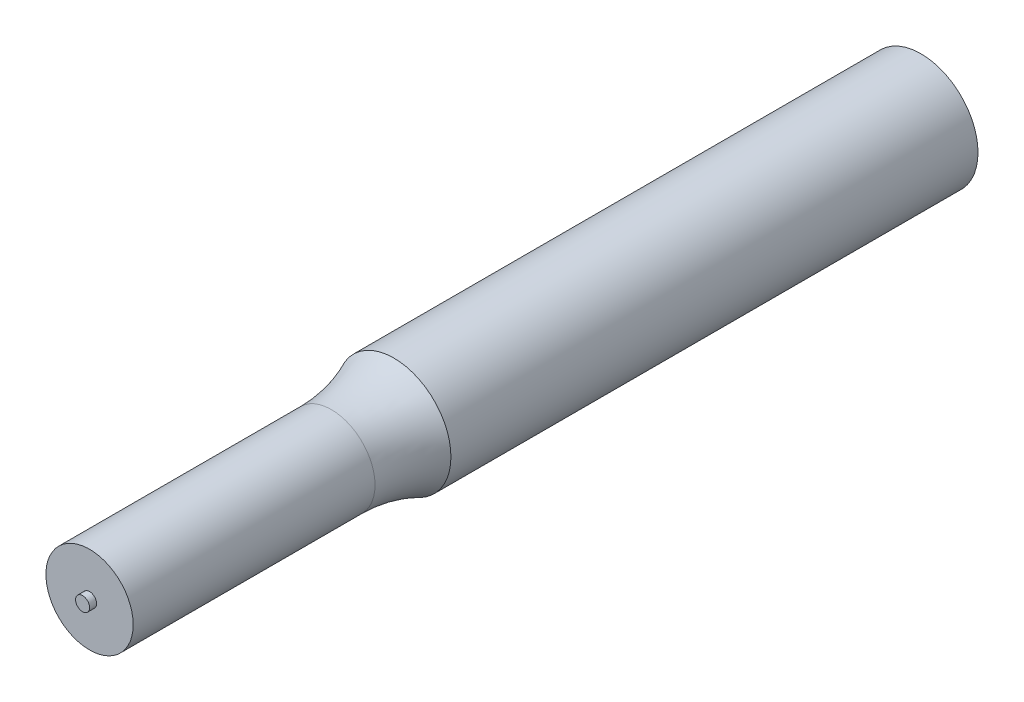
ISO-10303-21;
HEADER;
FILE_DESCRIPTION(('STEP AP214'),'2;1');
FILE_NAME('part.step','',(''),(''),'','','');
FILE_SCHEMA(('AUTOMOTIVE_DESIGN { 1 0 10303 214 1 1 1 1 }'));
ENDSEC;
DATA;
#1=APPLICATION_CONTEXT('core data for automotive mechanical design processes');
#2=APPLICATION_PROTOCOL_DEFINITION('international standard','automotive_design',2000,#1);
#3=PRODUCT_CONTEXT('',#1,'mechanical');
#4=PRODUCT('Part','Part','',(#3));
#5=PRODUCT_RELATED_PRODUCT_CATEGORY('part','',(#4));
#6=PRODUCT_DEFINITION_FORMATION('','',#4);
#7=PRODUCT_DEFINITION_CONTEXT('part definition',#1,'design');
#8=PRODUCT_DEFINITION('design','',#6,#7);
#9=PRODUCT_DEFINITION_SHAPE('','',#8);
#10=(LENGTH_UNIT() NAMED_UNIT(*) SI_UNIT(.MILLI.,.METRE.));
#11=(NAMED_UNIT(*) PLANE_ANGLE_UNIT() SI_UNIT($,.RADIAN.));
#12=(NAMED_UNIT(*) SI_UNIT($,.STERADIAN.) SOLID_ANGLE_UNIT());
#13=UNCERTAINTY_MEASURE_WITH_UNIT(LENGTH_MEASURE(1.E-05),#10,'distance_accuracy_value','');
#14=(GEOMETRIC_REPRESENTATION_CONTEXT(3) GLOBAL_UNCERTAINTY_ASSIGNED_CONTEXT((#13)) GLOBAL_UNIT_ASSIGNED_CONTEXT((#10,
#11,#12)) REPRESENTATION_CONTEXT('',''));
#15=CARTESIAN_POINT('',(0.,0.,0.));
#16=DIRECTION('',(0.,0.,1.));
#17=DIRECTION('',(1.,0.,0.));
#18=AXIS2_PLACEMENT_3D('',#15,#16,#17);
#19=CARTESIAN_POINT('',(-4.7625,0.,6.35000000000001));
#20=DIRECTION('',(0.,0.,1.));
#21=DIRECTION('',(1.,0.,0.));
#22=AXIS2_PLACEMENT_3D('',#19,#20,#21);
#23=PLANE('',#22);
#24=CARTESIAN_POINT('',(0.,0.,6.35000000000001));
#25=DIRECTION('',(0.,0.,1.));
#26=DIRECTION('',(1.,0.,0.));
#27=AXIS2_PLACEMENT_3D('',#24,#25,#26);
#28=CIRCLE('',#27,4.7625);
#29=CARTESIAN_POINT('',(4.7625,0.,6.35000000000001));
#30=VERTEX_POINT('',#29);
#31=EDGE_CURVE('E68',#30,#30,#28,.T.);
#32=ORIENTED_EDGE('',*,*,#31,.F.);
#33=EDGE_LOOP('',(#32));
#34=FACE_BOUND('',#33,.T.);
#35=ADVANCED_FACE('F43',(#34),#23,.F.);
#36=CARTESIAN_POINT('',(0.,0.,43.5171681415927));
#37=DIRECTION('',(0.,0.,1.));
#38=DIRECTION('',(1.,0.,0.));
#39=AXIS2_PLACEMENT_3D('',#36,#37,#38);
#40=CYLINDRICAL_SURFACE('',#39,4.7625);
#41=CARTESIAN_POINT('',(-4.28513619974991,-2.0782237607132,22.5146995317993));
#42=CARTESIAN_POINT('',(-4.30275987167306,-2.04187865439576,22.3744324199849));
#43=CARTESIAN_POINT('',(-4.32004921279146,-2.00505798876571,22.2342453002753));
#44=CARTESIAN_POINT('',(-4.35395724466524,-1.93032471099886,21.9540735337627));
#45=CARTESIAN_POINT('',(-4.37057590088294,-1.89241204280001,21.8140888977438));
#46=CARTESIAN_POINT('',(-4.40316777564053,-1.81528898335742,21.5341297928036));
#47=CARTESIAN_POINT('',(-4.41913979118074,-1.77607639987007,21.3941557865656));
#48=CARTESIAN_POINT('',(-4.45040250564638,-1.69622031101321,21.1145432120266));
#49=CARTESIAN_POINT('',(-4.46569322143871,-1.65557684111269,20.9749046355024));
#50=CARTESIAN_POINT('',(-4.49576991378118,-1.57208543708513,20.6943627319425));
#51=CARTESIAN_POINT('',(-4.51054748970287,-1.52921670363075,20.5534646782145));
#52=CARTESIAN_POINT('',(-4.53939040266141,-1.44134707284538,20.2722623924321));
#53=CARTESIAN_POINT('',(-4.55345575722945,-1.39634622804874,20.1319581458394));
#54=CARTESIAN_POINT('',(-4.58085125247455,-1.30366496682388,19.8522721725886));
#55=CARTESIAN_POINT('',(-4.59418190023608,-1.25598644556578,19.712889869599));
#56=CARTESIAN_POINT('',(-4.62009473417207,-1.15704714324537,19.435338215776));
#57=CARTESIAN_POINT('',(-4.63267703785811,-1.10578692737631,19.2971686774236));
#58=CARTESIAN_POINT('',(-4.64893621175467,-1.03398974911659,19.1141052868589));
#59=CARTESIAN_POINT('',(-4.65296506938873,-1.01571867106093,19.0683535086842));
#60=CARTESIAN_POINT('',(-4.66093144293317,-0.978512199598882,18.9771114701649));
#61=CARTESIAN_POINT('',(-4.66486895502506,-0.959576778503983,18.9316212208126));
#62=CARTESIAN_POINT('',(-4.67652844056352,-0.901690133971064,18.795748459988));
#63=CARTESIAN_POINT('',(-4.68410955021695,-0.861605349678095,18.7058266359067));
#64=CARTESIAN_POINT('',(-4.69675579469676,-0.789194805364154,18.5531968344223));
#65=CARTESIAN_POINT('',(-4.70192415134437,-0.75789732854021,18.490010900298));
#66=CARTESIAN_POINT('',(-4.71202329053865,-0.69235043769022,18.364984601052));
#67=CARTESIAN_POINT('',(-4.71695359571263,-0.65809544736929,18.3031470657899));
#68=CARTESIAN_POINT('',(-4.7266054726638,-0.584811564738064,18.1805770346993));
#69=CARTESIAN_POINT('',(-4.73132055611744,-0.545698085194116,18.119894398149));
#70=CARTESIAN_POINT('',(-4.74029566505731,-0.461332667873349,18.0029571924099));
#71=CARTESIAN_POINT('',(-4.74455737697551,-0.416105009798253,17.9466864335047));
#72=CARTESIAN_POINT('',(-4.74996776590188,-0.345841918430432,17.8744864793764));
#73=CARTESIAN_POINT('',(-4.7514510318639,-0.324956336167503,17.8545964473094));
#74=CARTESIAN_POINT('',(-4.75424286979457,-0.281185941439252,17.8170111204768));
#75=CARTESIAN_POINT('',(-4.75555114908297,-0.258297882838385,17.7993195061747));
#76=CARTESIAN_POINT('',(-4.75793533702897,-0.209890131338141,17.7669715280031));
#77=CARTESIAN_POINT('',(-4.75900741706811,-0.184335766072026,17.7523653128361));
#78=CARTESIAN_POINT('',(-4.76077375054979,-0.130928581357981,17.7282463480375));
#79=CARTESIAN_POINT('',(-4.7614697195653,-0.103086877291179,17.7187104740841));
#80=CARTESIAN_POINT('',(-4.76222305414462,-0.054967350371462,17.7083806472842));
#81=CARTESIAN_POINT('',(-4.76241276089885,-0.0350814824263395,17.7057759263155));
#82=CARTESIAN_POINT('',(-4.76253925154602,0.00484638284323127,17.7040395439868));
#83=CARTESIAN_POINT('',(-4.76247609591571,0.0248883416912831,17.7049070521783));
#84=CARTESIAN_POINT('',(-4.76210483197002,0.0644601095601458,17.7100016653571));
#85=CARTESIAN_POINT('',(-4.76179749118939,0.0839913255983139,17.7142182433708));
#86=CARTESIAN_POINT('',(-4.76097079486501,0.122186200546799,17.7255414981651));
#87=CARTESIAN_POINT('',(-4.76045123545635,0.140849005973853,17.7326509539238));
#88=CARTESIAN_POINT('',(-4.75886367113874,0.188388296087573,17.7543269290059));
#89=CARTESIAN_POINT('',(-4.75765559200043,0.216390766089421,17.7707805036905));
#90=CARTESIAN_POINT('',(-4.75493638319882,0.269632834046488,17.8076417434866));
#91=CARTESIAN_POINT('',(-4.75342427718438,0.294863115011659,17.8280621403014));
#92=CARTESIAN_POINT('',(-4.74967836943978,0.35067953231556,17.8783867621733));
#93=CARTESIAN_POINT('',(-4.74736846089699,0.380396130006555,17.9092348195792));
#94=CARTESIAN_POINT('',(-4.74251206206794,0.436789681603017,17.9736099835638));
#95=CARTESIAN_POINT('',(-4.73996508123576,0.463460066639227,18.0071426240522));
#96=CARTESIAN_POINT('',(-4.7346850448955,0.514614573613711,18.0761272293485));
#97=CARTESIAN_POINT('',(-4.73195093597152,0.539084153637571,18.1115897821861));
#98=CARTESIAN_POINT('',(-4.7263508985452,0.586149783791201,18.1836589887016));
#99=CARTESIAN_POINT('',(-4.72348511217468,0.608747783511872,18.2202643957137));
#100=CARTESIAN_POINT('',(-4.71432087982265,0.677366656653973,18.3364008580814));
#101=CARTESIAN_POINT('',(-4.70782322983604,0.720815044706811,18.4174300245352));
#102=CARTESIAN_POINT('',(-4.69442969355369,0.803410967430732,18.5816370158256));
#103=CARTESIAN_POINT('',(-4.68753349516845,0.842555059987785,18.6648164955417));
#104=CARTESIAN_POINT('',(-4.67337835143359,0.917829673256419,18.8327264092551));
#105=CARTESIAN_POINT('',(-4.66611859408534,0.953952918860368,18.917460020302));
#106=CARTESIAN_POINT('',(-4.65127825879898,1.02385923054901,19.0878634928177));
#107=CARTESIAN_POINT('',(-4.64369763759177,1.05764197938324,19.1735334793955));
#108=CARTESIAN_POINT('',(-4.62047930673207,1.15636409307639,19.4317713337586));
#109=CARTESIAN_POINT('',(-4.60438443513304,1.21857842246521,19.6053376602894));
#110=CARTESIAN_POINT('',(-4.57107074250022,1.33810837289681,19.9537410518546));
#111=CARTESIAN_POINT('',(-4.55385350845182,1.39543065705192,20.1285760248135));
#112=CARTESIAN_POINT('',(-4.51745004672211,1.50923538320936,20.4876758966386));
#113=CARTESIAN_POINT('',(-4.49820894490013,1.5655448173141,20.6719898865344));
#114=CARTESIAN_POINT('',(-4.45851376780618,1.67524879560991,21.0414478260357));
#115=CARTESIAN_POINT('',(-4.43805909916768,1.72864188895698,21.2265921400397));
#116=CARTESIAN_POINT('',(-4.39618460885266,1.83250446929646,21.5954068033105));
#117=CARTESIAN_POINT('',(-4.3747775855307,1.88299928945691,21.7790714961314));
#118=CARTESIAN_POINT('',(-4.33081712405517,1.98200339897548,22.1466804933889));
#119=CARTESIAN_POINT('',(-4.30826437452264,2.03051385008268,22.3306245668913));
#120=CARTESIAN_POINT('',(-4.28513619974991,2.0782237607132,22.5146995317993));
#121=B_SPLINE_CURVE_WITH_KNOTS('',3,(#41,#42,#43,#44,#45,#46,#47,#48,#49,#50,#51,#52,#53,#54,
#55,#56,#57,#58,#59,#60,#61,#62,#63,#64,#65,#66,#67,#68,#69,#70,#71,#72,#73,#74,#75,#76,#77,#78,
#79,#80,#81,#82,#83,#84,#85,#86,#87,#88,#89,#90,#91,#92,#93,#94,#95,#96,#97,#98,#99,#100,#101,
#102,#103,#104,#105,#106,#107,#108,#109,#110,#111,#112,#113,#114,#115,#116,#117,#118,#119,#120),
.UNSPECIFIED.,.F.,.F.,(4,2,2,2,2,2,2,2,2,2,2,2,2,2,2,2,2,2,2,2,2,2,2,2,2,2,2,2,2,2,2,2,2,2,2,2,
2,2,2,4),(0.,0.437902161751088,0.875826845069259,1.3145319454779,1.75322617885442,
2.19725594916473,2.64127478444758,3.08498322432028,3.52862180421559,3.67690586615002,
3.82519611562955,4.12133354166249,4.33339225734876,4.54585991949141,4.76275389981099,
4.9788105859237,5.06533964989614,5.15201167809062,5.23999931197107,5.3275821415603,
5.38747151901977,5.44734657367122,5.50703416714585,5.56677923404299,5.66371595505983,
5.76096909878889,5.88934173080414,6.0179861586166,6.14742623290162,6.27672972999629,
6.55300643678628,6.82950249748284,7.10664633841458,7.38382767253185,7.93894139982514,
8.49328655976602,9.07429485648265,9.65558961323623,10.230610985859,10.8052907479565),.UNSPECIFIED.);
#122=CARTESIAN_POINT('',(-4.28516132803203,-2.07817194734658,22.5144995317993));
#123=VERTEX_POINT('',#122);
#124=CARTESIAN_POINT('',(-4.28516132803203,2.07817194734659,22.5144995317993));
#125=VERTEX_POINT('',#124);
#126=EDGE_CURVE('E56',#123,#125,#121,.T.);
#127=ORIENTED_EDGE('',*,*,#126,.T.);
#128=CARTESIAN_POINT('',(-4.28518645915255,2.0781201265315,22.5142995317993));
#129=CARTESIAN_POINT('',(-4.27508654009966,2.09891062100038,22.5945482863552));
#130=CARTESIAN_POINT('',(-4.26636960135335,2.11653477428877,22.6757796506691));
#131=CARTESIAN_POINT('',(-4.25188606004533,2.14550059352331,22.8396038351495));
#132=CARTESIAN_POINT('',(-4.24611906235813,2.15684310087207,22.9221964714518));
#133=CARTESIAN_POINT('',(-4.2377171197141,2.17330108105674,23.0881583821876));
#134=CARTESIAN_POINT('',(-4.23508206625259,2.17841676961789,23.1715276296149));
#135=CARTESIAN_POINT('',(-4.23300540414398,2.18244548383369,23.3384349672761));
#136=CARTESIAN_POINT('',(-4.23356387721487,2.18135835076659,23.4219730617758));
#137=CARTESIAN_POINT('',(-4.24004320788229,2.168780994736,23.6719695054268));
#138=CARTESIAN_POINT('',(-4.25076012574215,2.1479900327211,23.8379653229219));
#139=CARTESIAN_POINT('',(-4.28383911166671,2.08122275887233,24.1636318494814));
#140=CARTESIAN_POINT('',(-4.30620527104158,2.03523759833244,24.323300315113));
#141=CARTESIAN_POINT('',(-4.35972441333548,1.91789887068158,24.6300696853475));
#142=CARTESIAN_POINT('',(-4.39080672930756,1.84674817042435,24.7772597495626));
#143=CARTESIAN_POINT('',(-4.45782384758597,1.67849821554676,25.054700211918));
#144=CARTESIAN_POINT('',(-4.49375031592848,1.58144325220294,25.184978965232));
#145=CARTESIAN_POINT('',(-4.5553699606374,1.39177868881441,25.3898781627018));
#146=CARTESIAN_POINT('',(-4.58119038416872,1.30513124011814,25.4700020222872));
#147=CARTESIAN_POINT('',(-4.63012133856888,1.11919575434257,25.6150540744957));
#148=CARTESIAN_POINT('',(-4.65323344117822,1.01991511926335,25.6799911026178));
#149=CARTESIAN_POINT('',(-4.69437686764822,0.80978616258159,25.7921438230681));
#150=CARTESIAN_POINT('',(-4.71237030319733,0.698859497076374,25.8392281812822));
#151=CARTESIAN_POINT('',(-4.74072356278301,0.469319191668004,25.9122634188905));
#152=CARTESIAN_POINT('',(-4.75108963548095,0.350711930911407,25.9382315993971));
#153=CARTESIAN_POINT('',(-4.76201233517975,0.125456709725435,25.9655296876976));
#154=CARTESIAN_POINT('',(-4.76363851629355,0.0191802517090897,25.9695470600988));
#155=CARTESIAN_POINT('',(-4.75978585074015,-0.192423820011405,25.9599618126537));
#156=CARTESIAN_POINT('',(-4.75430916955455,-0.297751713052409,25.946364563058));
#157=CARTESIAN_POINT('',(-4.7373299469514,-0.498765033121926,25.9034493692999));
#158=CARTESIAN_POINT('',(-4.72615916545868,-0.59466631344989,25.8749950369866));
#159=CARTESIAN_POINT('',(-4.69905719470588,-0.780441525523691,25.8041829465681));
#160=CARTESIAN_POINT('',(-4.68312529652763,-0.870314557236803,25.7618231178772));
#161=CARTESIAN_POINT('',(-4.64669241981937,-1.04806005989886,25.6615730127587));
#162=CARTESIAN_POINT('',(-4.62595904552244,-1.13540767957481,25.6028412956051));
#163=CARTESIAN_POINT('',(-4.58239415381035,-1.30013258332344,25.4734355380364));
#164=CARTESIAN_POINT('',(-4.55956165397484,-1.37750515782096,25.4027558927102));
#165=CARTESIAN_POINT('',(-4.51018722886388,-1.53203111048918,25.2405372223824));
#166=CARTESIAN_POINT('',(-4.48358468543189,-1.60754786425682,25.1474600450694));
#167=CARTESIAN_POINT('',(-4.43213048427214,-1.74441395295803,24.9510075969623));
#168=CARTESIAN_POINT('',(-4.40727977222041,-1.80575567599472,24.8476268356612));
#169=CARTESIAN_POINT('',(-4.35739676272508,-1.92334221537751,24.6152288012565));
#170=CARTESIAN_POINT('',(-4.33301234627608,-1.97707196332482,24.4847974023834));
#171=CARTESIAN_POINT('',(-4.29140780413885,-2.06582329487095,24.2165924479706));
#172=CARTESIAN_POINT('',(-4.2741933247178,-2.1008301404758,24.0788132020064));
#173=CARTESIAN_POINT('',(-4.24683455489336,-2.15566222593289,23.7818506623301));
#174=CARTESIAN_POINT('',(-4.23781963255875,-2.17309198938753,23.6221183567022));
#175=CARTESIAN_POINT('',(-4.23167132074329,-2.18504384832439,23.3016511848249));
#176=CARTESIAN_POINT('',(-4.23452831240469,-2.17958448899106,23.1409172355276));
#177=CARTESIAN_POINT('',(-4.24742407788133,-2.15426508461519,22.90273221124));
#178=CARTESIAN_POINT('',(-4.25313121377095,-2.1430226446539,22.8240285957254));
#179=CARTESIAN_POINT('',(-4.26720839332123,-2.11484513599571,22.6680313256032));
#180=CARTESIAN_POINT('',(-4.27557381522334,-2.09791994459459,22.5907354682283));
#181=CARTESIAN_POINT('',(-4.28518645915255,-2.0781201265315,22.5142995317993));
#182=B_SPLINE_CURVE_WITH_KNOTS('',3,(#128,#129,#130,#131,#132,#133,#134,#135,#136,#137,#138,
#139,#140,#141,#142,#143,#144,#145,#146,#147,#148,#149,#150,#151,#152,#153,#154,#155,#156,#157,
#158,#159,#160,#161,#162,#163,#164,#165,#166,#167,#168,#169,#170,#171,#172,#173,#174,#175,#176,
#177,#178,#179,#180,#181),.UNSPECIFIED.,.F.,.F.,(4,2,2,2,2,2,2,2,2,2,2,2,2,2,2,2,2,2,2,2,2,2,2,
2,2,2,4),(0.,0.250439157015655,0.500844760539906,0.751241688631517,1.00164502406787,
1.50198873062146,2.00250828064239,2.49908165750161,2.99481136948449,3.3557972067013,
3.71657250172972,4.07995261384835,4.44303469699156,4.76046245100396,5.07779345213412,
5.37844980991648,5.67915095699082,5.99972715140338,6.32045415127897,6.68737527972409,
7.05449298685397,7.48224377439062,7.91033077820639,8.39104585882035,8.87137153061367,
9.1102674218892,9.34875021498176),.UNSPECIFIED.);
#183=EDGE_CURVE('E11',#125,#123,#182,.T.);
#184=ORIENTED_EDGE('',*,*,#183,.T.);
#185=EDGE_LOOP('',(#127,#184));
#186=FACE_BOUND('',#185,.T.);
#187=CARTESIAN_POINT('',(0.,0.,50.34153));
#188=DIRECTION('',(0.,0.,1.));
#189=DIRECTION('',(1.,0.,0.));
#190=AXIS2_PLACEMENT_3D('',#187,#188,#189);
#191=CIRCLE('',#190,4.76249999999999);
#192=CARTESIAN_POINT('',(4.76249999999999,0.,50.34153));
#193=VERTEX_POINT('',#192);
#194=EDGE_CURVE('E81',#193,#193,#191,.T.);
#195=ORIENTED_EDGE('',*,*,#194,.F.);
#196=EDGE_LOOP('',(#195));
#197=FACE_BOUND('',#196,.T.);
#198=ORIENTED_EDGE('',*,*,#31,.T.);
#199=EDGE_LOOP('',(#198));
#200=FACE_BOUND('',#199,.T.);
#201=ADVANCED_FACE('F74',(#186,#197,#200),#40,.T.);
#202=CARTESIAN_POINT('',(0.,0.,55.5565891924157));
#203=DIRECTION('',(0.,0.,1.));
#204=DIRECTION('',(1.,0.,0.));
#205=AXIS2_PLACEMENT_3D('',#202,#203,#204);
#206=TOROIDAL_SURFACE('',#205,16.34236,12.7);
#207=CARTESIAN_POINT('',(0.,0.,55.5565891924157));
#208=DIRECTION('',(0.,0.,1.));
#209=DIRECTION('',(1.,0.,0.));
#210=AXIS2_PLACEMENT_3D('',#207,#208,#209);
#211=CIRCLE('',#210,3.64235999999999);
#212=CARTESIAN_POINT('',(3.64235999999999,0.,55.5565891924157));
#213=VERTEX_POINT('',#212);
#214=EDGE_CURVE('E89',#213,#213,#211,.T.);
#215=ORIENTED_EDGE('',*,*,#214,.F.);
#216=EDGE_LOOP('',(#215));
#217=FACE_BOUND('',#216,.T.);
#218=ORIENTED_EDGE('',*,*,#194,.T.);
#219=EDGE_LOOP('',(#218));
#220=FACE_BOUND('',#219,.T.);
#221=ADVANCED_FACE('F77',(#217,#220),#206,.F.);
#222=CARTESIAN_POINT('',(0.,0.,43.5171681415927));
#223=DIRECTION('',(0.,0.,1.));
#224=DIRECTION('',(1.,0.,0.));
#225=AXIS2_PLACEMENT_3D('',#222,#223,#224);
#226=CYLINDRICAL_SURFACE('',#225,3.64235999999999);
#227=CARTESIAN_POINT('',(0.,0.,75.74153));
#228=DIRECTION('',(0.,0.,1.));
#229=DIRECTION('',(1.,0.,0.));
#230=AXIS2_PLACEMENT_3D('',#227,#228,#229);
#231=CIRCLE('',#230,3.64235999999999);
#232=CARTESIAN_POINT('',(3.64235999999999,0.,75.74153));
#233=VERTEX_POINT('',#232);
#234=EDGE_CURVE('E96',#233,#233,#231,.T.);
#235=ORIENTED_EDGE('',*,*,#234,.F.);
#236=EDGE_LOOP('',(#235));
#237=FACE_BOUND('',#236,.T.);
#238=ORIENTED_EDGE('',*,*,#214,.T.);
#239=EDGE_LOOP('',(#238));
#240=FACE_BOUND('',#239,.T.);
#241=ADVANCED_FACE('F120',(#237,#240),#226,.T.);
#242=CARTESIAN_POINT('',(0.,0.,75.74153));
#243=DIRECTION('',(0.,0.,-1.));
#244=DIRECTION('',(-1.,0.,0.));
#245=AXIS2_PLACEMENT_3D('',#242,#243,#244);
#246=PLANE('',#245);
#247=CARTESIAN_POINT('',(0.,0.,75.74153));
#248=DIRECTION('',(0.,0.,-1.));
#249=DIRECTION('',(-1.,0.,0.));
#250=AXIS2_PLACEMENT_3D('',#247,#248,#249);
#251=CIRCLE('',#250,0.584200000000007);
#252=CARTESIAN_POINT('',(-0.584200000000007,0.,75.74153));
#253=VERTEX_POINT('',#252);
#254=EDGE_CURVE('E93',#253,#253,#251,.T.);
#255=ORIENTED_EDGE('',*,*,#254,.T.);
#256=EDGE_LOOP('',(#255));
#257=FACE_BOUND('',#256,.T.);
#258=ORIENTED_EDGE('',*,*,#234,.T.);
#259=EDGE_LOOP('',(#258));
#260=FACE_BOUND('',#259,.T.);
#261=ADVANCED_FACE('F113',(#257,#260),#246,.F.);
#262=CARTESIAN_POINT('',(0.,0.,0.));
#263=DIRECTION('',(0.,0.,-1.));
#264=DIRECTION('',(-1.,0.,0.));
#265=AXIS2_PLACEMENT_3D('',#262,#263,#264);
#266=CYLINDRICAL_SURFACE('',#265,0.584200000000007);
#267=CARTESIAN_POINT('',(0.,0.,76.32573));
#268=DIRECTION('',(0.,0.,-1.));
#269=DIRECTION('',(-1.,0.,0.));
#270=AXIS2_PLACEMENT_3D('',#267,#268,#269);
#271=CIRCLE('',#270,0.584200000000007);
#272=CARTESIAN_POINT('',(-0.584200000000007,0.,76.32573));
#273=VERTEX_POINT('',#272);
#274=EDGE_CURVE('E72',#273,#273,#271,.T.);
#275=ORIENTED_EDGE('',*,*,#274,.T.);
#276=EDGE_LOOP('',(#275));
#277=FACE_BOUND('',#276,.T.);
#278=ORIENTED_EDGE('',*,*,#254,.F.);
#279=EDGE_LOOP('',(#278));
#280=FACE_BOUND('',#279,.T.);
#281=ADVANCED_FACE('F110',(#277,#280),#266,.T.);
#282=CARTESIAN_POINT('',(0.,0.,76.32573));
#283=DIRECTION('',(0.,0.,1.));
#284=DIRECTION('',(1.,0.,0.));
#285=AXIS2_PLACEMENT_3D('',#282,#283,#284);
#286=PLANE('',#285);
#287=ORIENTED_EDGE('',*,*,#274,.F.);
#288=EDGE_LOOP('',(#287));
#289=FACE_BOUND('',#288,.T.);
#290=ADVANCED_FACE('F109',(#289),#286,.T.);
#291=CARTESIAN_POINT('',(-6.54049999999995,0.,23.3362499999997));
#292=DIRECTION('',(0.,0.,-1.));
#293=DIRECTION('',(-1.,0.,0.));
#294=AXIS2_PLACEMENT_3D('',#291,#292,#293);
#295=SPHERICAL_SURFACE('',#294,3.175);
#296=CARTESIAN_POINT('',(-6.54049999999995,0.,22.5144995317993));
#297=DIRECTION('',(0.,0.,-1.));
#298=DIRECTION('',(-1.,0.,0.));
#299=AXIS2_PLACEMENT_3D('',#296,#297,#298);
#300=CIRCLE('',#299,3.0668144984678);
#301=EDGE_CURVE('E62',#125,#123,#300,.T.);
#302=ORIENTED_EDGE('',*,*,#301,.T.);
#303=ORIENTED_EDGE('',*,*,#183,.F.);
#304=EDGE_LOOP('',(#302,#303));
#305=FACE_BOUND('',#304,.T.);
#306=ADVANCED_FACE('F70',(#305),#295,.F.);
#307=CARTESIAN_POINT('',(-6.54049999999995,1.28369537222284E-13,11.0689920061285));
#308=DIRECTION('',(0.,0.,1.));
#309=DIRECTION('',(1.,0.,0.));
#310=AXIS2_PLACEMENT_3D('',#307,#308,#309);
#311=CONICAL_SURFACE('',#310,0.,0.261799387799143);
#312=ORIENTED_EDGE('',*,*,#301,.F.);
#313=ORIENTED_EDGE('',*,*,#126,.F.);
#314=EDGE_LOOP('',(#312,#313));
#315=FACE_BOUND('',#314,.T.);
#316=ADVANCED_FACE('F65',(#315),#311,.F.);
#317=CLOSED_SHELL('',(#35,#201,#221,#241,#261,#281,#290,#306,#316));
#318=MANIFOLD_SOLID_BREP('B2',#317);
#319=ADVANCED_BREP_SHAPE_REPRESENTATION('',(#18,#318),#14);
#320=SHAPE_DEFINITION_REPRESENTATION(#9,#319);
ENDSEC;
END-ISO-10303-21;
